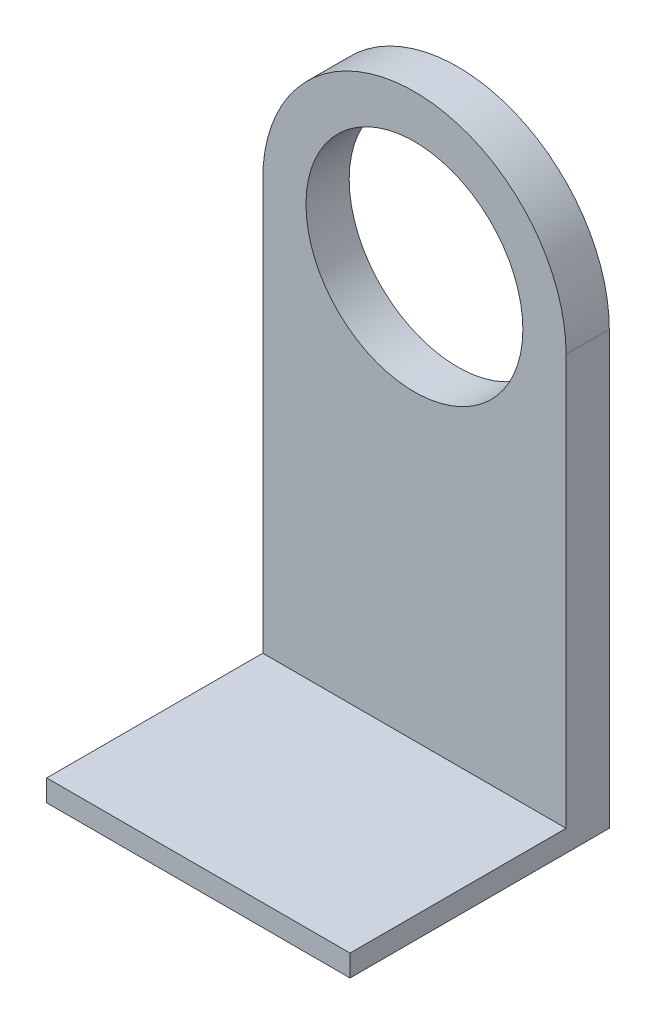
ISO-10303-21;
HEADER;
FILE_DESCRIPTION(('STEP AP214'),'2;1');
FILE_NAME('part.step','',(''),(''),'','','');
FILE_SCHEMA(('AUTOMOTIVE_DESIGN { 1 0 10303 214 1 1 1 1 }'));
ENDSEC;
DATA;
#1=APPLICATION_CONTEXT('core data for automotive mechanical design processes');
#2=APPLICATION_PROTOCOL_DEFINITION('international standard','automotive_design',2000,#1);
#3=PRODUCT_CONTEXT('',#1,'mechanical');
#4=PRODUCT('Part','Part','',(#3));
#5=PRODUCT_RELATED_PRODUCT_CATEGORY('part','',(#4));
#6=PRODUCT_DEFINITION_FORMATION('','',#4);
#7=PRODUCT_DEFINITION_CONTEXT('part definition',#1,'design');
#8=PRODUCT_DEFINITION('design','',#6,#7);
#9=PRODUCT_DEFINITION_SHAPE('','',#8);
#10=(LENGTH_UNIT() NAMED_UNIT(*) SI_UNIT(.MILLI.,.METRE.));
#11=(NAMED_UNIT(*) PLANE_ANGLE_UNIT() SI_UNIT($,.RADIAN.));
#12=(NAMED_UNIT(*) SI_UNIT($,.STERADIAN.) SOLID_ANGLE_UNIT());
#13=UNCERTAINTY_MEASURE_WITH_UNIT(LENGTH_MEASURE(1.E-05),#10,'distance_accuracy_value','');
#14=(GEOMETRIC_REPRESENTATION_CONTEXT(3) GLOBAL_UNCERTAINTY_ASSIGNED_CONTEXT((#13)) GLOBAL_UNIT_ASSIGNED_CONTEXT((#10,
#11,#12)) REPRESENTATION_CONTEXT('',''));
#15=CARTESIAN_POINT('',(0.,0.,0.));
#16=DIRECTION('',(0.,0.,1.));
#17=DIRECTION('',(1.,0.,0.));
#18=AXIS2_PLACEMENT_3D('',#15,#16,#17);
#19=CARTESIAN_POINT('',(-4.02455846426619E-13,0.,12.7));
#20=DIRECTION('',(0.,0.,1.));
#21=DIRECTION('',(1.,0.,0.));
#22=AXIS2_PLACEMENT_3D('',#19,#20,#21);
#23=PLANE('',#22);
#24=DIRECTION('',(-1.,0.,0.));
#25=VECTOR('',#24,1.);
#26=CARTESIAN_POINT('',(-44.5750000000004,-120.650000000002,12.7));
#27=LINE('',#26,#25);
#28=CARTESIAN_POINT('',(44.575,-120.65,12.7));
#29=VERTEX_POINT('',#28);
#30=CARTESIAN_POINT('',(-44.5750000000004,-120.650000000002,12.7));
#31=VERTEX_POINT('',#30);
#32=EDGE_CURVE('E48',#29,#31,#27,.T.);
#33=ORIENTED_EDGE('',*,*,#32,.F.);
#34=DIRECTION('',(0.,1.,0.));
#35=VECTOR('',#34,1.);
#36=CARTESIAN_POINT('',(44.575,-1.00613961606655E-13,12.7));
#37=LINE('',#36,#35);
#38=CARTESIAN_POINT('',(44.575,-1.00613961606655E-13,12.7));
#39=VERTEX_POINT('',#38);
#40=EDGE_CURVE('E53',#29,#39,#37,.T.);
#41=ORIENTED_EDGE('',*,*,#40,.T.);
#42=CARTESIAN_POINT('',(-4.02455846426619E-13,0.,12.7));
#43=DIRECTION('',(0.,0.,1.));
#44=DIRECTION('',(1.,0.,0.));
#45=AXIS2_PLACEMENT_3D('',#42,#43,#44);
#46=CIRCLE('',#45,44.575);
#47=CARTESIAN_POINT('',(-44.5750000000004,1.00613961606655E-13,12.7));
#48=VERTEX_POINT('',#47);
#49=EDGE_CURVE('E84',#39,#48,#46,.T.);
#50=ORIENTED_EDGE('',*,*,#49,.T.);
#51=DIRECTION('',(0.,-1.,0.));
#52=VECTOR('',#51,1.);
#53=CARTESIAN_POINT('',(-44.5750000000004,1.00613961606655E-13,12.7));
#54=LINE('',#53,#52);
#55=EDGE_CURVE('E109',#48,#31,#54,.T.);
#56=ORIENTED_EDGE('',*,*,#55,.T.);
#57=EDGE_LOOP('',(#33,#41,#50,#56));
#58=FACE_BOUND('',#57,.T.);
#59=CARTESIAN_POINT('',(-4.02455846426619E-13,0.,12.7));
#60=DIRECTION('',(0.,0.,1.));
#61=DIRECTION('',(1.,0.,0.));
#62=AXIS2_PLACEMENT_3D('',#59,#60,#61);
#63=CIRCLE('',#62,31.875);
#64=CARTESIAN_POINT('',(31.8749999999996,0.,12.7));
#65=VERTEX_POINT('',#64);
#66=EDGE_CURVE('E95',#65,#65,#63,.T.);
#67=ORIENTED_EDGE('',*,*,#66,.F.);
#68=EDGE_LOOP('',(#67));
#69=FACE_BOUND('',#68,.T.);
#70=ADVANCED_FACE('F31',(#58,#69),#23,.T.);
#71=CARTESIAN_POINT('',(0.,0.,0.));
#72=DIRECTION('',(0.,0.,1.));
#73=DIRECTION('',(1.,0.,0.));
#74=AXIS2_PLACEMENT_3D('',#71,#72,#73);
#75=PLANE('',#74);
#76=CARTESIAN_POINT('',(0.,0.,0.));
#77=DIRECTION('',(0.,0.,1.));
#78=DIRECTION('',(1.,0.,0.));
#79=AXIS2_PLACEMENT_3D('',#76,#77,#78);
#80=CIRCLE('',#79,44.575);
#81=CARTESIAN_POINT('',(44.575,-1.00613961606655E-13,0.));
#82=VERTEX_POINT('',#81);
#83=CARTESIAN_POINT('',(-44.5750000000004,0.,0.));
#84=VERTEX_POINT('',#83);
#85=EDGE_CURVE('E90',#82,#84,#80,.T.);
#86=ORIENTED_EDGE('',*,*,#85,.F.);
#87=DIRECTION('',(0.,1.,0.));
#88=VECTOR('',#87,1.);
#89=CARTESIAN_POINT('',(44.575,-1.00613961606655E-13,0.));
#90=LINE('',#89,#88);
#91=CARTESIAN_POINT('',(44.575,-127.,0.));
#92=VERTEX_POINT('',#91);
#93=EDGE_CURVE('E73',#92,#82,#90,.T.);
#94=ORIENTED_EDGE('',*,*,#93,.F.);
#95=DIRECTION('',(1.,0.,0.));
#96=VECTOR('',#95,1.);
#97=CARTESIAN_POINT('',(44.575,-127.,0.));
#98=LINE('',#97,#96);
#99=CARTESIAN_POINT('',(-44.5750000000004,-127.000000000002,0.));
#100=VERTEX_POINT('',#99);
#101=EDGE_CURVE('E85',#100,#92,#98,.T.);
#102=ORIENTED_EDGE('',*,*,#101,.F.);
#103=DIRECTION('',(0.,-1.,0.));
#104=VECTOR('',#103,1.);
#105=CARTESIAN_POINT('',(-44.5750000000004,0.,0.));
#106=LINE('',#105,#104);
#107=EDGE_CURVE('E94',#84,#100,#106,.T.);
#108=ORIENTED_EDGE('',*,*,#107,.F.);
#109=EDGE_LOOP('',(#86,#94,#102,#108));
#110=FACE_BOUND('',#109,.T.);
#111=CARTESIAN_POINT('',(0.,0.,0.));
#112=DIRECTION('',(0.,0.,1.));
#113=DIRECTION('',(1.,0.,0.));
#114=AXIS2_PLACEMENT_3D('',#111,#112,#113);
#115=CIRCLE('',#114,31.875);
#116=CARTESIAN_POINT('',(31.875,0.,0.));
#117=VERTEX_POINT('',#116);
#118=EDGE_CURVE('E99',#117,#117,#115,.T.);
#119=ORIENTED_EDGE('',*,*,#118,.T.);
#120=EDGE_LOOP('',(#119));
#121=FACE_BOUND('',#120,.T.);
#122=ADVANCED_FACE('F92',(#110,#121),#75,.F.);
#123=CARTESIAN_POINT('',(-4.02455846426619E-13,0.,12.7));
#124=DIRECTION('',(0.,0.,-1.));
#125=DIRECTION('',(-1.,0.,0.));
#126=AXIS2_PLACEMENT_3D('',#123,#124,#125);
#127=CYLINDRICAL_SURFACE('',#126,44.575);
#128=ORIENTED_EDGE('',*,*,#85,.T.);
#129=DIRECTION('',(0.,0.,-1.));
#130=VECTOR('',#129,1.);
#131=CARTESIAN_POINT('',(-44.5750000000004,1.00613961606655E-13,12.7));
#132=LINE('',#131,#130);
#133=EDGE_CURVE('E11',#48,#84,#132,.T.);
#134=ORIENTED_EDGE('',*,*,#133,.F.);
#135=ORIENTED_EDGE('',*,*,#49,.F.);
#136=DIRECTION('',(0.,0.,-1.));
#137=VECTOR('',#136,1.);
#138=CARTESIAN_POINT('',(44.575,-1.00613961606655E-13,12.7));
#139=LINE('',#138,#137);
#140=EDGE_CURVE('E76',#39,#82,#139,.T.);
#141=ORIENTED_EDGE('',*,*,#140,.T.);
#142=EDGE_LOOP('',(#128,#134,#135,#141));
#143=FACE_BOUND('',#142,.T.);
#144=ADVANCED_FACE('F33',(#143),#127,.T.);
#145=CARTESIAN_POINT('',(-44.5750000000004,1.00613961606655E-13,12.7));
#146=DIRECTION('',(1.,0.,0.));
#147=DIRECTION('',(0.,1.,0.));
#148=AXIS2_PLACEMENT_3D('',#145,#146,#147);
#149=PLANE('',#148);
#150=ORIENTED_EDGE('',*,*,#107,.T.);
#151=DIRECTION('',(0.,0.,-1.));
#152=VECTOR('',#151,1.);
#153=CARTESIAN_POINT('',(-44.5750000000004,-127.000000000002,12.7));
#154=LINE('',#153,#152);
#155=CARTESIAN_POINT('',(-44.5750000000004,-127.000000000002,76.2));
#156=VERTEX_POINT('',#155);
#157=EDGE_CURVE('E40',#156,#100,#154,.T.);
#158=ORIENTED_EDGE('',*,*,#157,.F.);
#159=DIRECTION('',(0.,-1.,0.));
#160=VECTOR('',#159,1.);
#161=CARTESIAN_POINT('',(-44.5750000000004,-120.650000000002,76.2));
#162=LINE('',#161,#160);
#163=CARTESIAN_POINT('',(-44.5750000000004,-120.650000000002,76.2));
#164=VERTEX_POINT('',#163);
#165=EDGE_CURVE('E123',#164,#156,#162,.T.);
#166=ORIENTED_EDGE('',*,*,#165,.F.);
#167=DIRECTION('',(0.,0.,-1.));
#168=VECTOR('',#167,1.);
#169=CARTESIAN_POINT('',(-44.5750000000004,-120.650000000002,76.2));
#170=LINE('',#169,#168);
#171=EDGE_CURVE('E124',#164,#31,#170,.T.);
#172=ORIENTED_EDGE('',*,*,#171,.T.);
#173=ORIENTED_EDGE('',*,*,#55,.F.);
#174=ORIENTED_EDGE('',*,*,#133,.T.);
#175=EDGE_LOOP('',(#150,#158,#166,#172,#173,#174));
#176=FACE_BOUND('',#175,.T.);
#177=ADVANCED_FACE('F151',(#176),#149,.F.);
#178=CARTESIAN_POINT('',(44.575,-127.,12.7));
#179=DIRECTION('',(0.,1.,0.));
#180=DIRECTION('',(0.,0.,1.));
#181=AXIS2_PLACEMENT_3D('',#178,#179,#180);
#182=PLANE('',#181);
#183=ORIENTED_EDGE('',*,*,#101,.T.);
#184=DIRECTION('',(0.,0.,-1.));
#185=VECTOR('',#184,1.);
#186=CARTESIAN_POINT('',(44.575,-127.,12.7));
#187=LINE('',#186,#185);
#188=CARTESIAN_POINT('',(44.575,-127.,76.2));
#189=VERTEX_POINT('',#188);
#190=EDGE_CURVE('E80',#189,#92,#187,.T.);
#191=ORIENTED_EDGE('',*,*,#190,.F.);
#192=DIRECTION('',(1.,0.,0.));
#193=VECTOR('',#192,1.);
#194=CARTESIAN_POINT('',(-44.5750000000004,-127.000000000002,76.2));
#195=LINE('',#194,#193);
#196=EDGE_CURVE('E154',#156,#189,#195,.T.);
#197=ORIENTED_EDGE('',*,*,#196,.F.);
#198=ORIENTED_EDGE('',*,*,#157,.T.);
#199=EDGE_LOOP('',(#183,#191,#197,#198));
#200=FACE_BOUND('',#199,.T.);
#201=ADVANCED_FACE('F155',(#200),#182,.F.);
#202=CARTESIAN_POINT('',(44.575,-1.00613961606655E-13,12.7));
#203=DIRECTION('',(-1.,0.,0.));
#204=DIRECTION('',(0.,-1.,0.));
#205=AXIS2_PLACEMENT_3D('',#202,#203,#204);
#206=PLANE('',#205);
#207=ORIENTED_EDGE('',*,*,#93,.T.);
#208=ORIENTED_EDGE('',*,*,#140,.F.);
#209=ORIENTED_EDGE('',*,*,#40,.F.);
#210=DIRECTION('',(0.,0.,-1.));
#211=VECTOR('',#210,1.);
#212=CARTESIAN_POINT('',(44.5749999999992,-120.65,76.2));
#213=LINE('',#212,#211);
#214=CARTESIAN_POINT('',(44.5749999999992,-120.65,76.2));
#215=VERTEX_POINT('',#214);
#216=EDGE_CURVE('E116',#215,#29,#213,.T.);
#217=ORIENTED_EDGE('',*,*,#216,.F.);
#218=DIRECTION('',(0.,1.,0.));
#219=VECTOR('',#218,1.);
#220=CARTESIAN_POINT('',(44.575,-127.,76.2));
#221=LINE('',#220,#219);
#222=EDGE_CURVE('E139',#189,#215,#221,.T.);
#223=ORIENTED_EDGE('',*,*,#222,.F.);
#224=ORIENTED_EDGE('',*,*,#190,.T.);
#225=EDGE_LOOP('',(#207,#208,#209,#217,#223,#224));
#226=FACE_BOUND('',#225,.T.);
#227=ADVANCED_FACE('F75',(#226),#206,.F.);
#228=CARTESIAN_POINT('',(-4.02455846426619E-13,0.,12.7));
#229=DIRECTION('',(0.,0.,-1.));
#230=DIRECTION('',(-1.,0.,0.));
#231=AXIS2_PLACEMENT_3D('',#228,#229,#230);
#232=CYLINDRICAL_SURFACE('',#231,31.875);
#233=ORIENTED_EDGE('',*,*,#66,.T.);
#234=EDGE_LOOP('',(#233));
#235=FACE_BOUND('',#234,.T.);
#236=ORIENTED_EDGE('',*,*,#118,.F.);
#237=EDGE_LOOP('',(#236));
#238=FACE_BOUND('',#237,.T.);
#239=ADVANCED_FACE('F164',(#235,#238),#232,.F.);
#240=CARTESIAN_POINT('',(-44.5750000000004,-120.650000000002,76.2));
#241=DIRECTION('',(0.,-1.,0.));
#242=DIRECTION('',(0.,0.,-1.));
#243=AXIS2_PLACEMENT_3D('',#240,#241,#242);
#244=PLANE('',#243);
#245=ORIENTED_EDGE('',*,*,#32,.T.);
#246=ORIENTED_EDGE('',*,*,#171,.F.);
#247=DIRECTION('',(-1.,0.,0.));
#248=VECTOR('',#247,1.);
#249=CARTESIAN_POINT('',(-44.5750000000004,-120.650000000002,76.2));
#250=LINE('',#249,#248);
#251=EDGE_CURVE('E120',#215,#164,#250,.T.);
#252=ORIENTED_EDGE('',*,*,#251,.F.);
#253=ORIENTED_EDGE('',*,*,#216,.T.);
#254=EDGE_LOOP('',(#245,#246,#252,#253));
#255=FACE_BOUND('',#254,.T.);
#256=ADVANCED_FACE('F132',(#255),#244,.F.);
#257=CARTESIAN_POINT('',(-44.5750000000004,-127.000000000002,76.2));
#258=DIRECTION('',(0.,0.,1.));
#259=DIRECTION('',(1.,0.,0.));
#260=AXIS2_PLACEMENT_3D('',#257,#258,#259);
#261=PLANE('',#260);
#262=ORIENTED_EDGE('',*,*,#165,.T.);
#263=ORIENTED_EDGE('',*,*,#196,.T.);
#264=ORIENTED_EDGE('',*,*,#222,.T.);
#265=ORIENTED_EDGE('',*,*,#251,.T.);
#266=EDGE_LOOP('',(#262,#263,#264,#265));
#267=FACE_BOUND('',#266,.T.);
#268=ADVANCED_FACE('F157',(#267),#261,.T.);
#269=CLOSED_SHELL('',(#70,#122,#144,#177,#201,#227,#239,#256,#268));
#270=MANIFOLD_SOLID_BREP('B2',#269);
#271=ADVANCED_BREP_SHAPE_REPRESENTATION('',(#18,#270),#14);
#272=SHAPE_DEFINITION_REPRESENTATION(#9,#271);
ENDSEC;
END-ISO-10303-21;
